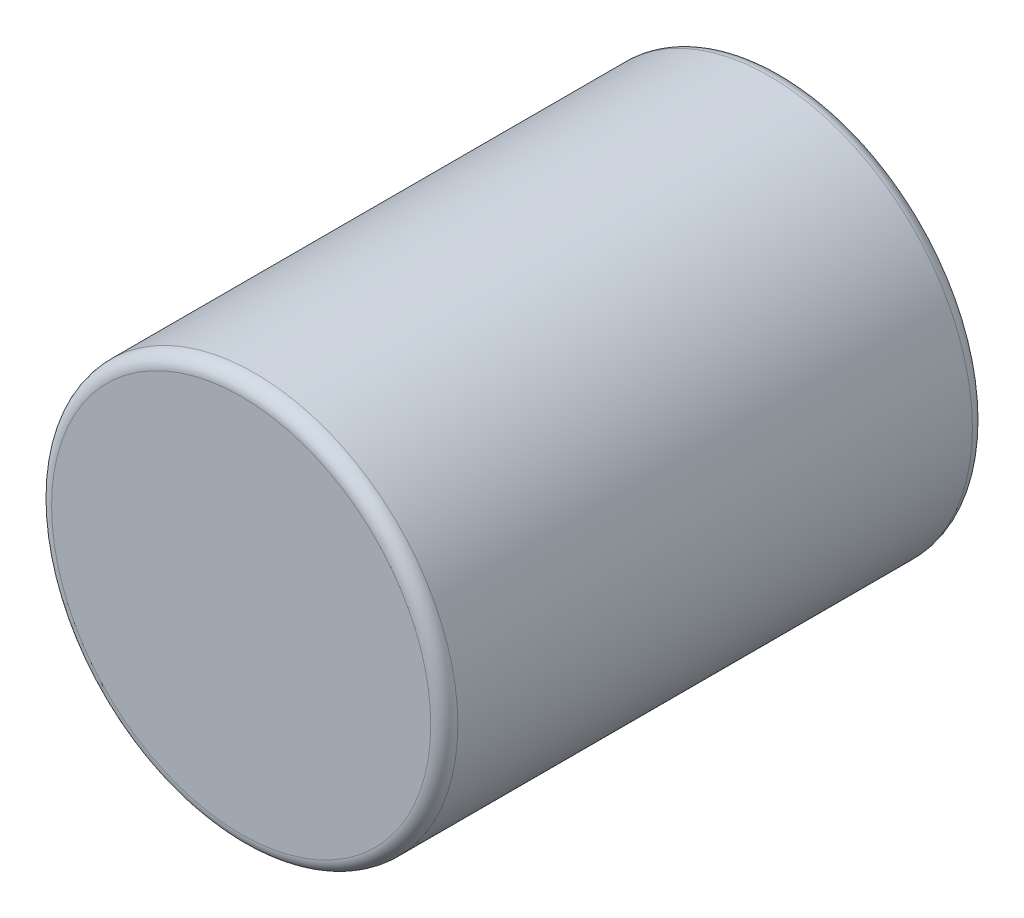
ISO-10303-21;
HEADER;
FILE_DESCRIPTION(('STEP AP214'),'2;1');
FILE_NAME('part.step','',(''),(''),'','','');
FILE_SCHEMA(('AUTOMOTIVE_DESIGN { 1 0 10303 214 1 1 1 1 }'));
ENDSEC;
DATA;
#1=APPLICATION_CONTEXT('core data for automotive mechanical design processes');
#2=APPLICATION_PROTOCOL_DEFINITION('international standard','automotive_design',2000,#1);
#3=PRODUCT_CONTEXT('',#1,'mechanical');
#4=PRODUCT('Part','Part','',(#3));
#5=PRODUCT_RELATED_PRODUCT_CATEGORY('part','',(#4));
#6=PRODUCT_DEFINITION_FORMATION('','',#4);
#7=PRODUCT_DEFINITION_CONTEXT('part definition',#1,'design');
#8=PRODUCT_DEFINITION('design','',#6,#7);
#9=PRODUCT_DEFINITION_SHAPE('','',#8);
#10=(LENGTH_UNIT() NAMED_UNIT(*) SI_UNIT(.MILLI.,.METRE.));
#11=(NAMED_UNIT(*) PLANE_ANGLE_UNIT() SI_UNIT($,.RADIAN.));
#12=(NAMED_UNIT(*) SI_UNIT($,.STERADIAN.) SOLID_ANGLE_UNIT());
#13=UNCERTAINTY_MEASURE_WITH_UNIT(LENGTH_MEASURE(1.E-05),#10,'distance_accuracy_value','');
#14=(GEOMETRIC_REPRESENTATION_CONTEXT(3) GLOBAL_UNCERTAINTY_ASSIGNED_CONTEXT((#13)) GLOBAL_UNIT_ASSIGNED_CONTEXT((#10,
#11,#12)) REPRESENTATION_CONTEXT('',''));
#15=CARTESIAN_POINT('',(0.,0.,0.));
#16=DIRECTION('',(0.,0.,1.));
#17=DIRECTION('',(1.,0.,0.));
#18=AXIS2_PLACEMENT_3D('',#15,#16,#17);
#19=CARTESIAN_POINT('',(0.,0.,4.));
#20=DIRECTION('',(0.,0.,-1.));
#21=DIRECTION('',(-1.,0.,0.));
#22=AXIS2_PLACEMENT_3D('',#19,#20,#21);
#23=CYLINDRICAL_SURFACE('',#22,1.5);
#24=CARTESIAN_POINT('',(0.,0.,0.0999999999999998));
#25=DIRECTION('',(0.,0.,1.));
#26=DIRECTION('',(1.,0.,0.));
#27=AXIS2_PLACEMENT_3D('',#24,#25,#26);
#28=CIRCLE('',#27,1.5);
#29=CARTESIAN_POINT('',(1.5,0.,0.0999999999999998));
#30=VERTEX_POINT('',#29);
#31=EDGE_CURVE('E42',#30,#30,#28,.T.);
#32=ORIENTED_EDGE('',*,*,#31,.T.);
#33=EDGE_LOOP('',(#32));
#34=FACE_BOUND('',#33,.T.);
#35=CARTESIAN_POINT('',(0.,0.,3.9));
#36=DIRECTION('',(0.,0.,1.));
#37=DIRECTION('',(1.,0.,0.));
#38=AXIS2_PLACEMENT_3D('',#35,#36,#37);
#39=CIRCLE('',#38,1.5);
#40=CARTESIAN_POINT('',(1.5,0.,3.9));
#41=VERTEX_POINT('',#40);
#42=EDGE_CURVE('E46',#41,#41,#39,.F.);
#43=ORIENTED_EDGE('',*,*,#42,.T.);
#44=EDGE_LOOP('',(#43));
#45=FACE_BOUND('',#44,.T.);
#46=ADVANCED_FACE('F31',(#34,#45),#23,.T.);
#47=CARTESIAN_POINT('',(0.,0.,4.));
#48=DIRECTION('',(0.,0.,1.));
#49=DIRECTION('',(1.,0.,0.));
#50=AXIS2_PLACEMENT_3D('',#47,#48,#49);
#51=PLANE('',#50);
#52=CARTESIAN_POINT('',(0.,0.,4.));
#53=DIRECTION('',(0.,0.,1.));
#54=DIRECTION('',(1.,0.,0.));
#55=AXIS2_PLACEMENT_3D('',#52,#53,#54);
#56=CIRCLE('',#55,1.4);
#57=CARTESIAN_POINT('',(1.4,0.,4.));
#58=VERTEX_POINT('',#57);
#59=EDGE_CURVE('E10',#58,#58,#56,.T.);
#60=ORIENTED_EDGE('',*,*,#59,.T.);
#61=EDGE_LOOP('',(#60));
#62=FACE_BOUND('',#61,.T.);
#63=ADVANCED_FACE('F62',(#62),#51,.T.);
#64=CARTESIAN_POINT('',(0.,0.,0.));
#65=DIRECTION('',(0.,0.,1.));
#66=DIRECTION('',(1.,0.,0.));
#67=AXIS2_PLACEMENT_3D('',#64,#65,#66);
#68=PLANE('',#67);
#69=CARTESIAN_POINT('',(0.,0.,0.));
#70=DIRECTION('',(0.,0.,1.));
#71=DIRECTION('',(1.,0.,0.));
#72=AXIS2_PLACEMENT_3D('',#69,#70,#71);
#73=CIRCLE('',#72,1.4);
#74=CARTESIAN_POINT('',(1.4,0.,0.));
#75=VERTEX_POINT('',#74);
#76=EDGE_CURVE('E38',#75,#75,#73,.F.);
#77=ORIENTED_EDGE('',*,*,#76,.T.);
#78=EDGE_LOOP('',(#77));
#79=FACE_BOUND('',#78,.T.);
#80=ADVANCED_FACE('F59',(#79),#68,.F.);
#81=CARTESIAN_POINT('',(0.,0.,0.0999999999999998));
#82=DIRECTION('',(0.,0.,1.));
#83=DIRECTION('',(1.,0.,0.));
#84=AXIS2_PLACEMENT_3D('',#81,#82,#83);
#85=TOROIDAL_SURFACE('',#84,1.4,0.1);
#86=ORIENTED_EDGE('',*,*,#76,.F.);
#87=EDGE_LOOP('',(#86));
#88=FACE_BOUND('',#87,.T.);
#89=ORIENTED_EDGE('',*,*,#31,.F.);
#90=EDGE_LOOP('',(#89));
#91=FACE_BOUND('',#90,.T.);
#92=ADVANCED_FACE('F55',(#88,#91),#85,.T.);
#93=CARTESIAN_POINT('',(0.,0.,3.9));
#94=DIRECTION('',(0.,0.,1.));
#95=DIRECTION('',(1.,0.,0.));
#96=AXIS2_PLACEMENT_3D('',#93,#94,#95);
#97=TOROIDAL_SURFACE('',#96,1.4,0.1);
#98=ORIENTED_EDGE('',*,*,#42,.F.);
#99=EDGE_LOOP('',(#98));
#100=FACE_BOUND('',#99,.T.);
#101=ORIENTED_EDGE('',*,*,#59,.F.);
#102=EDGE_LOOP('',(#101));
#103=FACE_BOUND('',#102,.T.);
#104=ADVANCED_FACE('F33',(#100,#103),#97,.T.);
#105=CLOSED_SHELL('',(#46,#63,#80,#92,#104));
#106=MANIFOLD_SOLID_BREP('B2',#105);
#107=ADVANCED_BREP_SHAPE_REPRESENTATION('',(#18,#106),#14);
#108=SHAPE_DEFINITION_REPRESENTATION(#9,#107);
ENDSEC;
END-ISO-10303-21;
